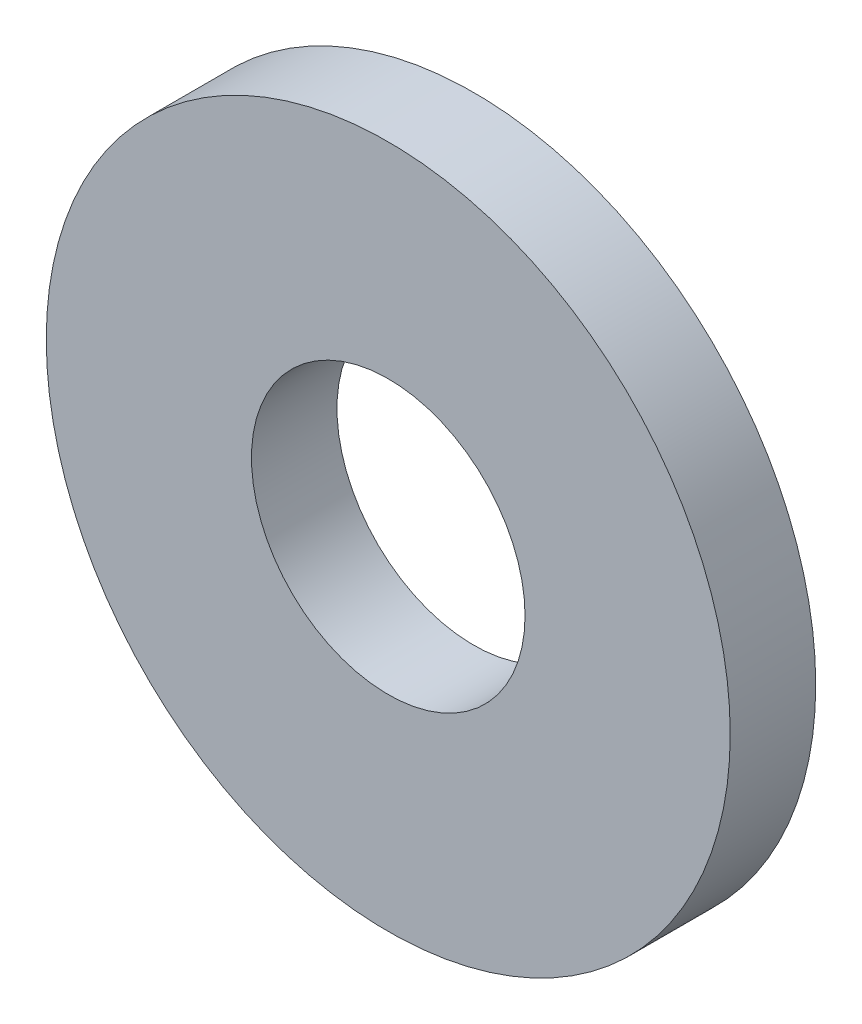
from build123d import *

# Parameters (mm, degrees)
ESQUISSE1_R      = 4
ESQUISSE1_R_2    = 1.6
EXTRUSION1_DEPTH = 1


with BuildPart() as part:
    # Esquisse1 → Extrusion1 (new body)
    with BuildSketch(Plane.XY):
        Circle(ESQUISSE1_R)
        Circle(ESQUISSE1_R_2, mode=Mode.SUBTRACT)
    extrude(amount=EXTRUSION1_DEPTH)


solid = part.part
